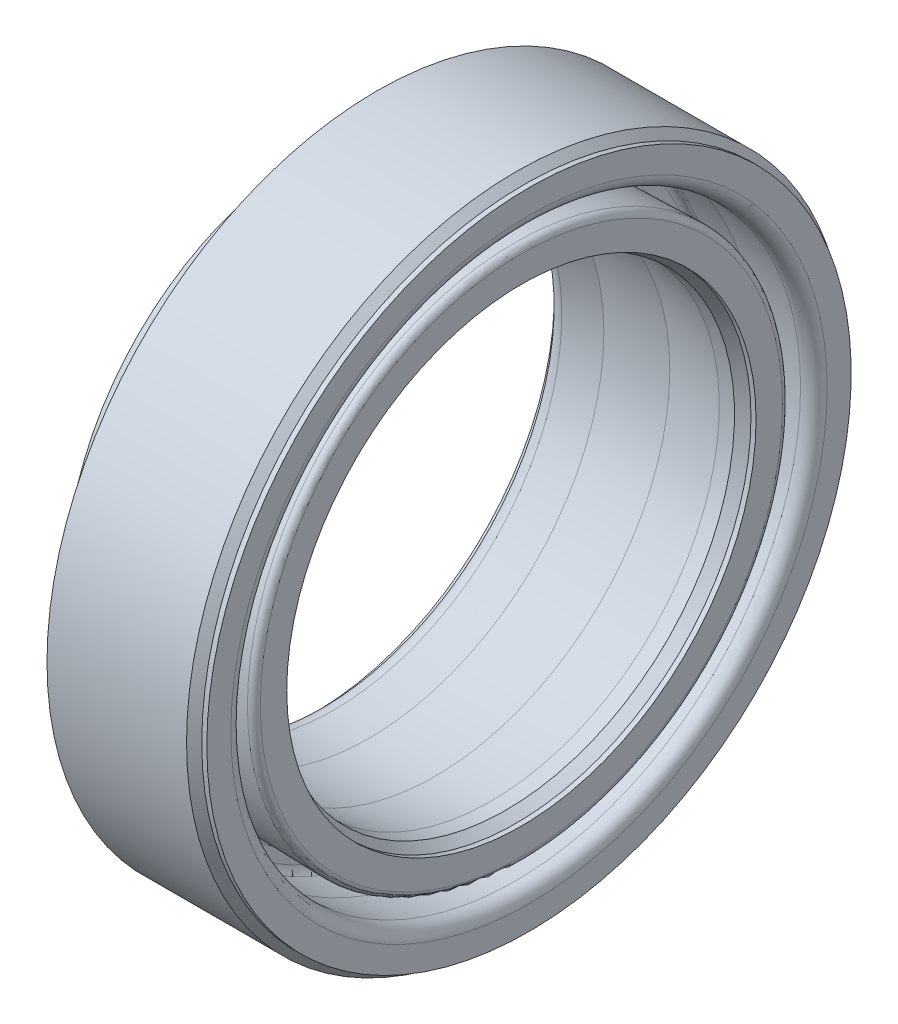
ISO-10303-21;
HEADER;
FILE_DESCRIPTION(('STEP AP214'),'2;1');
FILE_NAME('part.step','',(''),(''),'','','');
FILE_SCHEMA(('AUTOMOTIVE_DESIGN { 1 0 10303 214 1 1 1 1 }'));
ENDSEC;
DATA;
#1=APPLICATION_CONTEXT('core data for automotive mechanical design processes');
#2=APPLICATION_PROTOCOL_DEFINITION('international standard','automotive_design',2000,#1);
#3=PRODUCT_CONTEXT('',#1,'mechanical');
#4=PRODUCT('Part','Part','',(#3));
#5=PRODUCT_RELATED_PRODUCT_CATEGORY('part','',(#4));
#6=PRODUCT_DEFINITION_FORMATION('','',#4);
#7=PRODUCT_DEFINITION_CONTEXT('part definition',#1,'design');
#8=PRODUCT_DEFINITION('design','',#6,#7);
#9=PRODUCT_DEFINITION_SHAPE('','',#8);
#10=(LENGTH_UNIT() NAMED_UNIT(*) SI_UNIT(.MILLI.,.METRE.));
#11=(NAMED_UNIT(*) PLANE_ANGLE_UNIT() SI_UNIT($,.RADIAN.));
#12=(NAMED_UNIT(*) SI_UNIT($,.STERADIAN.) SOLID_ANGLE_UNIT());
#13=UNCERTAINTY_MEASURE_WITH_UNIT(LENGTH_MEASURE(1.E-05),#10,'distance_accuracy_value','');
#14=(GEOMETRIC_REPRESENTATION_CONTEXT(3) GLOBAL_UNCERTAINTY_ASSIGNED_CONTEXT((#13)) GLOBAL_UNIT_ASSIGNED_CONTEXT((#10,
#11,#12)) REPRESENTATION_CONTEXT('',''));
#15=CARTESIAN_POINT('',(0.,0.,0.));
#16=DIRECTION('',(0.,0.,1.));
#17=DIRECTION('',(1.,0.,0.));
#18=AXIS2_PLACEMENT_3D('',#15,#16,#17);
#19=CARTESIAN_POINT('',(563.646090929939,439.492949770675,0.));
#20=DIRECTION('',(-1.,0.,0.));
#21=DIRECTION('',(0.,0.,1.));
#22=AXIS2_PLACEMENT_3D('',#19,#20,#21);
#23=CYLINDRICAL_SURFACE('',#22,13.);
#24=CARTESIAN_POINT('',(575.435578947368,439.492949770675,0.));
#25=DIRECTION('',(-1.,0.,0.));
#26=DIRECTION('',(0.,0.,1.));
#27=AXIS2_PLACEMENT_3D('',#24,#25,#26);
#28=CIRCLE('',#27,13.);
#29=CARTESIAN_POINT('',(575.435578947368,439.492949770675,13.));
#30=VERTEX_POINT('',#29);
#31=EDGE_CURVE('E431',#30,#30,#28,.T.);
#32=ORIENTED_EDGE('',*,*,#31,.F.);
#33=EDGE_LOOP('',(#32));
#34=FACE_BOUND('',#33,.T.);
#35=CARTESIAN_POINT('',(580.935578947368,439.492949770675,0.));
#36=DIRECTION('',(-1.,0.,0.));
#37=DIRECTION('',(0.,0.,1.));
#38=AXIS2_PLACEMENT_3D('',#35,#36,#37);
#39=CIRCLE('',#38,13.);
#40=CARTESIAN_POINT('',(580.935578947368,439.492949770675,13.));
#41=VERTEX_POINT('',#40);
#42=EDGE_CURVE('E10',#41,#41,#39,.T.);
#43=ORIENTED_EDGE('',*,*,#42,.T.);
#44=EDGE_LOOP('',(#43));
#45=FACE_BOUND('',#44,.T.);
#46=ADVANCED_FACE('F346',(#34,#45),#23,.T.);
#47=CARTESIAN_POINT('',(581.235578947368,439.492949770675,0.));
#48=DIRECTION('',(-1.,0.,0.));
#49=DIRECTION('',(0.,0.,1.));
#50=AXIS2_PLACEMENT_3D('',#47,#48,#49);
#51=CONICAL_SURFACE('',#50,12.7,0.785398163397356);
#52=ORIENTED_EDGE('',*,*,#42,.F.);
#53=EDGE_LOOP('',(#52));
#54=FACE_BOUND('',#53,.T.);
#55=CARTESIAN_POINT('',(581.235578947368,439.492949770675,0.));
#56=DIRECTION('',(-1.,0.,0.));
#57=DIRECTION('',(0.,0.,1.));
#58=AXIS2_PLACEMENT_3D('',#55,#56,#57);
#59=CIRCLE('',#58,12.7);
#60=CARTESIAN_POINT('',(581.235578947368,439.492949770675,12.7));
#61=VERTEX_POINT('',#60);
#62=EDGE_CURVE('E352',#61,#61,#59,.T.);
#63=ORIENTED_EDGE('',*,*,#62,.T.);
#64=EDGE_LOOP('',(#63));
#65=FACE_BOUND('',#64,.T.);
#66=ADVANCED_FACE('F438',(#54,#65),#51,.T.);
#67=CARTESIAN_POINT('',(563.646090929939,439.492949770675,0.));
#68=DIRECTION('',(-1.,0.,0.));
#69=DIRECTION('',(0.,0.,1.));
#70=AXIS2_PLACEMENT_3D('',#67,#68,#69);
#71=CYLINDRICAL_SURFACE('',#70,12.7);
#72=ORIENTED_EDGE('',*,*,#62,.F.);
#73=EDGE_LOOP('',(#72));
#74=FACE_BOUND('',#73,.T.);
#75=CARTESIAN_POINT('',(581.435578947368,439.492949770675,0.));
#76=DIRECTION('',(-1.,0.,0.));
#77=DIRECTION('',(0.,0.,1.));
#78=AXIS2_PLACEMENT_3D('',#75,#76,#77);
#79=CIRCLE('',#78,12.7);
#80=CARTESIAN_POINT('',(581.435578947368,439.492949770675,12.7));
#81=VERTEX_POINT('',#80);
#82=EDGE_CURVE('E356',#81,#81,#79,.T.);
#83=ORIENTED_EDGE('',*,*,#82,.T.);
#84=EDGE_LOOP('',(#83));
#85=FACE_BOUND('',#84,.T.);
#86=ADVANCED_FACE('F442',(#74,#85),#71,.T.);
#87=CARTESIAN_POINT('',(581.435578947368,452.192949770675,0.));
#88=DIRECTION('',(-1.,0.,0.));
#89=DIRECTION('',(0.,0.,1.));
#90=AXIS2_PLACEMENT_3D('',#87,#88,#89);
#91=PLANE('',#90);
#92=ORIENTED_EDGE('',*,*,#82,.F.);
#93=EDGE_LOOP('',(#92));
#94=FACE_BOUND('',#93,.T.);
#95=CARTESIAN_POINT('',(581.435578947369,439.492949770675,0.));
#96=DIRECTION('',(-1.,0.,0.));
#97=DIRECTION('',(0.,0.,1.));
#98=AXIS2_PLACEMENT_3D('',#95,#96,#97);
#99=CIRCLE('',#98,11.7524937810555);
#100=CARTESIAN_POINT('',(581.435578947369,439.492949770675,11.7524937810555));
#101=VERTEX_POINT('',#100);
#102=EDGE_CURVE('E360',#101,#101,#99,.T.);
#103=ORIENTED_EDGE('',*,*,#102,.T.);
#104=EDGE_LOOP('',(#103));
#105=FACE_BOUND('',#104,.T.);
#106=ADVANCED_FACE('F447',(#94,#105),#91,.F.);
#107=CARTESIAN_POINT('',(580.935578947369,439.492949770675,0.));
#108=DIRECTION('',(-1.,0.,0.));
#109=DIRECTION('',(0.,0.,1.));
#110=AXIS2_PLACEMENT_3D('',#107,#108,#109);
#111=TOROIDAL_SURFACE('',#110,11.7524937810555,0.500000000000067);
#112=ORIENTED_EDGE('',*,*,#102,.F.);
#113=EDGE_LOOP('',(#112));
#114=FACE_BOUND('',#113,.T.);
#115=CARTESIAN_POINT('',(580.885827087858,439.492949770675,0.));
#116=DIRECTION('',(-1.,0.,0.));
#117=DIRECTION('',(0.,0.,1.));
#118=AXIS2_PLACEMENT_3D('',#115,#116,#117);
#119=CIRCLE('',#118,11.254975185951);
#120=CARTESIAN_POINT('',(580.885827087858,439.492949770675,11.254975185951));
#121=VERTEX_POINT('',#120);
#122=EDGE_CURVE('E365',#121,#121,#119,.T.);
#123=ORIENTED_EDGE('',*,*,#122,.T.);
#124=EDGE_LOOP('',(#123));
#125=FACE_BOUND('',#124,.T.);
#126=ADVANCED_FACE('F453',(#114,#125),#111,.T.);
#127=CARTESIAN_POINT('',(578.935578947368,439.492949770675,0.));
#128=DIRECTION('',(-1.,0.,0.));
#129=DIRECTION('',(0.,0.,1.));
#130=AXIS2_PLACEMENT_3D('',#127,#128,#129);
#131=CONICAL_SURFACE('',#130,11.45,0.099668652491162);
#132=ORIENTED_EDGE('',*,*,#122,.F.);
#133=EDGE_LOOP('',(#132));
#134=FACE_BOUND('',#133,.T.);
#135=CARTESIAN_POINT('',(578.935578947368,439.492949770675,0.));
#136=DIRECTION('',(-1.,0.,0.));
#137=DIRECTION('',(0.,0.,1.));
#138=AXIS2_PLACEMENT_3D('',#135,#136,#137);
#139=CIRCLE('',#138,11.45);
#140=CARTESIAN_POINT('',(578.935578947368,439.492949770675,11.45));
#141=VERTEX_POINT('',#140);
#142=EDGE_CURVE('E368',#141,#141,#139,.T.);
#143=ORIENTED_EDGE('',*,*,#142,.T.);
#144=EDGE_LOOP('',(#143));
#145=FACE_BOUND('',#144,.T.);
#146=ADVANCED_FACE('F457',(#134,#145),#131,.F.);
#147=CARTESIAN_POINT('',(563.646090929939,439.492949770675,0.));
#148=DIRECTION('',(-1.,0.,0.));
#149=DIRECTION('',(0.,0.,1.));
#150=AXIS2_PLACEMENT_3D('',#147,#148,#149);
#151=CYLINDRICAL_SURFACE('',#150,11.4499999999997);
#152=ORIENTED_EDGE('',*,*,#142,.F.);
#153=EDGE_LOOP('',(#152));
#154=FACE_BOUND('',#153,.T.);
#155=CARTESIAN_POINT('',(577.485578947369,439.492949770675,0.));
#156=DIRECTION('',(-1.,0.,0.));
#157=DIRECTION('',(0.,0.,1.));
#158=AXIS2_PLACEMENT_3D('',#155,#156,#157);
#159=CIRCLE('',#158,11.4499999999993);
#160=CARTESIAN_POINT('',(577.485578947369,439.492949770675,11.4499999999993));
#161=VERTEX_POINT('',#160);
#162=EDGE_CURVE('E371',#161,#161,#159,.T.);
#163=ORIENTED_EDGE('',*,*,#162,.T.);
#164=EDGE_LOOP('',(#163));
#165=FACE_BOUND('',#164,.T.);
#166=ADVANCED_FACE('F461',(#154,#165),#151,.F.);
#167=CARTESIAN_POINT('',(577.485578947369,439.492949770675,0.));
#168=DIRECTION('',(-1.,0.,0.));
#169=DIRECTION('',(0.,0.,1.));
#170=AXIS2_PLACEMENT_3D('',#167,#168,#169);
#171=TOROIDAL_SURFACE('',#170,11.1999999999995,0.250000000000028);
#172=ORIENTED_EDGE('',*,*,#162,.F.);
#173=EDGE_LOOP('',(#172));
#174=FACE_BOUND('',#173,.T.);
#175=CARTESIAN_POINT('',(577.235578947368,439.492949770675,0.));
#176=DIRECTION('',(-1.,0.,0.));
#177=DIRECTION('',(0.,0.,1.));
#178=AXIS2_PLACEMENT_3D('',#175,#176,#177);
#179=CIRCLE('',#178,11.2);
#180=CARTESIAN_POINT('',(577.235578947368,439.492949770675,11.2));
#181=VERTEX_POINT('',#180);
#182=EDGE_CURVE('E374',#181,#181,#179,.T.);
#183=ORIENTED_EDGE('',*,*,#182,.T.);
#184=EDGE_LOOP('',(#183));
#185=FACE_BOUND('',#184,.T.);
#186=ADVANCED_FACE('F465',(#174,#185),#171,.F.);
#187=CARTESIAN_POINT('',(577.235578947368,450.692949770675,0.));
#188=DIRECTION('',(-1.,0.,0.));
#189=DIRECTION('',(0.,0.,1.));
#190=AXIS2_PLACEMENT_3D('',#187,#188,#189);
#191=PLANE('',#190);
#192=ORIENTED_EDGE('',*,*,#182,.F.);
#193=EDGE_LOOP('',(#192));
#194=FACE_BOUND('',#193,.T.);
#195=CARTESIAN_POINT('',(577.235578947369,439.492949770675,0.));
#196=DIRECTION('',(-1.,0.,0.));
#197=DIRECTION('',(0.,0.,1.));
#198=AXIS2_PLACEMENT_3D('',#195,#196,#197);
#199=CIRCLE('',#198,10.7064924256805);
#200=CARTESIAN_POINT('',(577.235578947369,439.492949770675,10.7064924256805));
#201=VERTEX_POINT('',#200);
#202=EDGE_CURVE('E377',#201,#201,#199,.T.);
#203=ORIENTED_EDGE('',*,*,#202,.T.);
#204=EDGE_LOOP('',(#203));
#205=FACE_BOUND('',#204,.T.);
#206=ADVANCED_FACE('F469',(#194,#205),#191,.F.);
#207=CARTESIAN_POINT('',(577.485578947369,439.492949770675,0.));
#208=DIRECTION('',(-1.,0.,0.));
#209=DIRECTION('',(0.,0.,1.));
#210=AXIS2_PLACEMENT_3D('',#207,#208,#209);
#211=TOROIDAL_SURFACE('',#210,10.7064924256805,0.249999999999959);
#212=ORIENTED_EDGE('',*,*,#202,.F.);
#213=EDGE_LOOP('',(#212));
#214=FACE_BOUND('',#213,.T.);
#215=CARTESIAN_POINT('',(577.491987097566,439.492949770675,0.));
#216=DIRECTION('',(-1.,0.,0.));
#217=DIRECTION('',(0.,0.,1.));
#218=AXIS2_PLACEMENT_3D('',#215,#216,#217);
#219=CIRCLE('',#218,10.4565745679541);
#220=CARTESIAN_POINT('',(577.491987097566,439.492949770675,10.4565745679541));
#221=VERTEX_POINT('',#220);
#222=EDGE_CURVE('E380',#221,#221,#219,.T.);
#223=ORIENTED_EDGE('',*,*,#222,.T.);
#224=EDGE_LOOP('',(#223));
#225=FACE_BOUND('',#224,.T.);
#226=ADVANCED_FACE('F473',(#214,#225),#211,.F.);
#227=CARTESIAN_POINT('',(580.879170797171,439.492949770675,0.));
#228=DIRECTION('',(1.,0.,0.));
#229=DIRECTION('',(0.,0.,-1.));
#230=AXIS2_PLACEMENT_3D('',#227,#228,#229);
#231=CONICAL_SURFACE('',#230,10.5434254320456,0.0256354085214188);
#232=ORIENTED_EDGE('',*,*,#222,.F.);
#233=EDGE_LOOP('',(#232));
#234=FACE_BOUND('',#233,.T.);
#235=CARTESIAN_POINT('',(580.879170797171,439.492949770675,0.));
#236=DIRECTION('',(-1.,0.,0.));
#237=DIRECTION('',(0.,0.,1.));
#238=AXIS2_PLACEMENT_3D('',#235,#236,#237);
#239=CIRCLE('',#238,10.5434254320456);
#240=CARTESIAN_POINT('',(580.879170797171,439.492949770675,10.5434254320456));
#241=VERTEX_POINT('',#240);
#242=EDGE_CURVE('E383',#241,#241,#239,.T.);
#243=ORIENTED_EDGE('',*,*,#242,.T.);
#244=EDGE_LOOP('',(#243));
#245=FACE_BOUND('',#244,.T.);
#246=ADVANCED_FACE('F477',(#234,#245),#231,.T.);
#247=CARTESIAN_POINT('',(580.885578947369,439.492949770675,0.));
#248=DIRECTION('',(-1.,0.,0.));
#249=DIRECTION('',(0.,0.,1.));
#250=AXIS2_PLACEMENT_3D('',#247,#248,#249);
#251=TOROIDAL_SURFACE('',#250,10.2935075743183,0.249999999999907);
#252=ORIENTED_EDGE('',*,*,#242,.F.);
#253=EDGE_LOOP('',(#252));
#254=FACE_BOUND('',#253,.T.);
#255=CARTESIAN_POINT('',(581.135578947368,439.492949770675,0.));
#256=DIRECTION('',(-1.,0.,0.));
#257=DIRECTION('',(0.,0.,1.));
#258=AXIS2_PLACEMENT_3D('',#255,#256,#257);
#259=CIRCLE('',#258,10.293507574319);
#260=CARTESIAN_POINT('',(581.135578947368,439.492949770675,10.293507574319));
#261=VERTEX_POINT('',#260);
#262=EDGE_CURVE('E386',#261,#261,#259,.T.);
#263=ORIENTED_EDGE('',*,*,#262,.T.);
#264=EDGE_LOOP('',(#263));
#265=FACE_BOUND('',#264,.T.);
#266=ADVANCED_FACE('F481',(#254,#265),#251,.T.);
#267=CARTESIAN_POINT('',(581.135578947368,449.786457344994,0.));
#268=DIRECTION('',(-1.,0.,0.));
#269=DIRECTION('',(0.,0.,1.));
#270=AXIS2_PLACEMENT_3D('',#267,#268,#269);
#271=PLANE('',#270);
#272=ORIENTED_EDGE('',*,*,#262,.F.);
#273=EDGE_LOOP('',(#272));
#274=FACE_BOUND('',#273,.T.);
#275=CARTESIAN_POINT('',(581.135578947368,439.492949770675,0.));
#276=DIRECTION('',(-1.,0.,0.));
#277=DIRECTION('',(0.,0.,1.));
#278=AXIS2_PLACEMENT_3D('',#275,#276,#277);
#279=CIRCLE('',#278,9.25000000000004);
#280=CARTESIAN_POINT('',(581.135578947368,439.492949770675,9.25000000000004));
#281=VERTEX_POINT('',#280);
#282=EDGE_CURVE('E389',#281,#281,#279,.T.);
#283=ORIENTED_EDGE('',*,*,#282,.T.);
#284=EDGE_LOOP('',(#283));
#285=FACE_BOUND('',#284,.T.);
#286=ADVANCED_FACE('F485',(#274,#285),#271,.F.);
#287=CARTESIAN_POINT('',(563.646090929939,439.492949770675,0.));
#288=DIRECTION('',(-1.,0.,0.));
#289=DIRECTION('',(0.,0.,1.));
#290=AXIS2_PLACEMENT_3D('',#287,#288,#289);
#291=CYLINDRICAL_SURFACE('',#290,9.25000000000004);
#292=ORIENTED_EDGE('',*,*,#282,.F.);
#293=EDGE_LOOP('',(#292));
#294=FACE_BOUND('',#293,.T.);
#295=CARTESIAN_POINT('',(580.935578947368,439.492949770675,0.));
#296=DIRECTION('',(-1.,0.,0.));
#297=DIRECTION('',(0.,0.,1.));
#298=AXIS2_PLACEMENT_3D('',#295,#296,#297);
#299=CIRCLE('',#298,9.25000000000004);
#300=CARTESIAN_POINT('',(580.935578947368,439.492949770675,9.25000000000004));
#301=VERTEX_POINT('',#300);
#302=EDGE_CURVE('E392',#301,#301,#299,.T.);
#303=ORIENTED_EDGE('',*,*,#302,.T.);
#304=EDGE_LOOP('',(#303));
#305=FACE_BOUND('',#304,.T.);
#306=ADVANCED_FACE('F489',(#294,#305),#291,.F.);
#307=CARTESIAN_POINT('',(580.535578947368,439.492949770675,0.));
#308=DIRECTION('',(1.,0.,0.));
#309=DIRECTION('',(0.,0.,-1.));
#310=AXIS2_PLACEMENT_3D('',#307,#308,#309);
#311=CONICAL_SURFACE('',#310,8.99999999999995,0.558599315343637);
#312=ORIENTED_EDGE('',*,*,#302,.F.);
#313=EDGE_LOOP('',(#312));
#314=FACE_BOUND('',#313,.T.);
#315=CARTESIAN_POINT('',(580.535578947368,439.492949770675,0.));
#316=DIRECTION('',(-1.,0.,0.));
#317=DIRECTION('',(0.,0.,1.));
#318=AXIS2_PLACEMENT_3D('',#315,#316,#317);
#319=CIRCLE('',#318,8.99999999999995);
#320=CARTESIAN_POINT('',(580.535578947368,439.492949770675,8.99999999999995));
#321=VERTEX_POINT('',#320);
#322=EDGE_CURVE('E395',#321,#321,#319,.T.);
#323=ORIENTED_EDGE('',*,*,#322,.T.);
#324=EDGE_LOOP('',(#323));
#325=FACE_BOUND('',#324,.T.);
#326=ADVANCED_FACE('F493',(#314,#325),#311,.F.);
#327=CARTESIAN_POINT('',(563.646090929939,439.492949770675,0.));
#328=DIRECTION('',(-1.,0.,0.));
#329=DIRECTION('',(0.,0.,1.));
#330=AXIS2_PLACEMENT_3D('',#327,#328,#329);
#331=CYLINDRICAL_SURFACE('',#330,8.99999999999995);
#332=ORIENTED_EDGE('',*,*,#322,.F.);
#333=EDGE_LOOP('',(#332));
#334=FACE_BOUND('',#333,.T.);
#335=CARTESIAN_POINT('',(579.935578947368,439.492949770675,0.));
#336=DIRECTION('',(-1.,0.,0.));
#337=DIRECTION('',(0.,0.,1.));
#338=AXIS2_PLACEMENT_3D('',#335,#336,#337);
#339=CIRCLE('',#338,8.99999999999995);
#340=CARTESIAN_POINT('',(579.935578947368,439.492949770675,8.99999999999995));
#341=VERTEX_POINT('',#340);
#342=EDGE_CURVE('E398',#341,#341,#339,.T.);
#343=ORIENTED_EDGE('',*,*,#342,.T.);
#344=EDGE_LOOP('',(#343));
#345=FACE_BOUND('',#344,.T.);
#346=ADVANCED_FACE('F497',(#334,#345),#331,.F.);
#347=CARTESIAN_POINT('',(577.735578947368,439.492949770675,0.));
#348=DIRECTION('',(-1.,0.,0.));
#349=DIRECTION('',(0.,0.,1.));
#350=AXIS2_PLACEMENT_3D('',#347,#348,#349);
#351=CONICAL_SURFACE('',#350,9.25000000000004,0.113150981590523);
#352=ORIENTED_EDGE('',*,*,#342,.F.);
#353=EDGE_LOOP('',(#352));
#354=FACE_BOUND('',#353,.T.);
#355=CARTESIAN_POINT('',(577.735578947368,439.492949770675,0.));
#356=DIRECTION('',(-1.,0.,0.));
#357=DIRECTION('',(0.,0.,1.));
#358=AXIS2_PLACEMENT_3D('',#355,#356,#357);
#359=CIRCLE('',#358,9.25000000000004);
#360=CARTESIAN_POINT('',(577.735578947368,439.492949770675,9.25000000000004));
#361=VERTEX_POINT('',#360);
#362=EDGE_CURVE('E401',#361,#361,#359,.T.);
#363=ORIENTED_EDGE('',*,*,#362,.T.);
#364=EDGE_LOOP('',(#363));
#365=FACE_BOUND('',#364,.T.);
#366=ADVANCED_FACE('F501',(#354,#365),#351,.F.);
#367=CARTESIAN_POINT('',(563.646090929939,439.492949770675,0.));
#368=DIRECTION('',(-1.,0.,0.));
#369=DIRECTION('',(0.,0.,1.));
#370=AXIS2_PLACEMENT_3D('',#367,#368,#369);
#371=CYLINDRICAL_SURFACE('',#370,9.25000000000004);
#372=ORIENTED_EDGE('',*,*,#362,.F.);
#373=EDGE_LOOP('',(#372));
#374=FACE_BOUND('',#373,.T.);
#375=CARTESIAN_POINT('',(575.135578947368,439.492949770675,0.));
#376=DIRECTION('',(-1.,0.,0.));
#377=DIRECTION('',(0.,0.,1.));
#378=AXIS2_PLACEMENT_3D('',#375,#376,#377);
#379=CIRCLE('',#378,9.25000000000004);
#380=CARTESIAN_POINT('',(575.135578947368,439.492949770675,9.25000000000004));
#381=VERTEX_POINT('',#380);
#382=EDGE_CURVE('E404',#381,#381,#379,.T.);
#383=ORIENTED_EDGE('',*,*,#382,.T.);
#384=EDGE_LOOP('',(#383));
#385=FACE_BOUND('',#384,.T.);
#386=ADVANCED_FACE('F505',(#374,#385),#371,.F.);
#387=CARTESIAN_POINT('',(573.720111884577,439.492949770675,0.));
#388=DIRECTION('',(1.,0.,0.));
#389=DIRECTION('',(0.,0.,-1.));
#390=AXIS2_PLACEMENT_3D('',#387,#388,#389);
#391=CONICAL_SURFACE('',#390,9.00719762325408,0.16988182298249);
#392=ORIENTED_EDGE('',*,*,#382,.F.);
#393=EDGE_LOOP('',(#392));
#394=FACE_BOUND('',#393,.T.);
#395=CARTESIAN_POINT('',(573.720111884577,439.492949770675,0.));
#396=DIRECTION('',(-1.,0.,0.));
#397=DIRECTION('',(0.,0.,1.));
#398=AXIS2_PLACEMENT_3D('',#395,#396,#397);
#399=CIRCLE('',#398,9.00719762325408);
#400=CARTESIAN_POINT('',(573.720111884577,439.492949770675,9.00719762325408));
#401=VERTEX_POINT('',#400);
#402=EDGE_CURVE('E407',#401,#401,#399,.T.);
#403=ORIENTED_EDGE('',*,*,#402,.T.);
#404=EDGE_LOOP('',(#403));
#405=FACE_BOUND('',#404,.T.);
#406=ADVANCED_FACE('F509',(#394,#405),#391,.F.);
#407=CARTESIAN_POINT('',(573.635578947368,439.492949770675,0.));
#408=DIRECTION('',(-1.,0.,0.));
#409=DIRECTION('',(0.,0.,1.));
#410=AXIS2_PLACEMENT_3D('',#407,#408,#409);
#411=TOROIDAL_SURFACE('',#410,9.50000000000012,0.499999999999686);
#412=ORIENTED_EDGE('',*,*,#402,.F.);
#413=EDGE_LOOP('',(#412));
#414=FACE_BOUND('',#413,.T.);
#415=CARTESIAN_POINT('',(573.135578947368,439.492949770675,0.));
#416=DIRECTION('',(-1.,0.,0.));
#417=DIRECTION('',(0.,0.,1.));
#418=AXIS2_PLACEMENT_3D('',#415,#416,#417);
#419=CIRCLE('',#418,9.49999999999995);
#420=CARTESIAN_POINT('',(573.135578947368,439.492949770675,9.49999999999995));
#421=VERTEX_POINT('',#420);
#422=EDGE_CURVE('E410',#421,#421,#419,.T.);
#423=ORIENTED_EDGE('',*,*,#422,.T.);
#424=EDGE_LOOP('',(#423));
#425=FACE_BOUND('',#424,.T.);
#426=ADVANCED_FACE('F513',(#414,#425),#411,.T.);
#427=CARTESIAN_POINT('',(563.646090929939,439.492949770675,0.));
#428=DIRECTION('',(-1.,0.,0.));
#429=DIRECTION('',(0.,0.,1.));
#430=AXIS2_PLACEMENT_3D('',#427,#428,#429);
#431=CYLINDRICAL_SURFACE('',#430,9.49999999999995);
#432=ORIENTED_EDGE('',*,*,#422,.F.);
#433=EDGE_LOOP('',(#432));
#434=FACE_BOUND('',#433,.T.);
#435=CARTESIAN_POINT('',(572.935578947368,439.492949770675,0.));
#436=DIRECTION('',(-1.,0.,0.));
#437=DIRECTION('',(0.,0.,1.));
#438=AXIS2_PLACEMENT_3D('',#435,#436,#437);
#439=CIRCLE('',#438,9.49999999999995);
#440=CARTESIAN_POINT('',(572.935578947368,439.492949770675,9.49999999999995));
#441=VERTEX_POINT('',#440);
#442=EDGE_CURVE('E413',#441,#441,#439,.T.);
#443=ORIENTED_EDGE('',*,*,#442,.T.);
#444=EDGE_LOOP('',(#443));
#445=FACE_BOUND('',#444,.T.);
#446=ADVANCED_FACE('F517',(#434,#445),#431,.F.);
#447=CARTESIAN_POINT('',(572.935578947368,448.992949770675,0.));
#448=DIRECTION('',(1.,0.,0.));
#449=DIRECTION('',(0.,0.,-1.));
#450=AXIS2_PLACEMENT_3D('',#447,#448,#449);
#451=PLANE('',#450);
#452=ORIENTED_EDGE('',*,*,#442,.F.);
#453=EDGE_LOOP('',(#452));
#454=FACE_BOUND('',#453,.T.);
#455=CARTESIAN_POINT('',(572.935578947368,439.492949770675,0.));
#456=DIRECTION('',(-1.,0.,0.));
#457=DIRECTION('',(0.,0.,1.));
#458=AXIS2_PLACEMENT_3D('',#455,#456,#457);
#459=CIRCLE('',#458,9.75000000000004);
#460=CARTESIAN_POINT('',(572.935578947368,439.492949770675,9.75000000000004));
#461=VERTEX_POINT('',#460);
#462=EDGE_CURVE('E416',#461,#461,#459,.T.);
#463=ORIENTED_EDGE('',*,*,#462,.T.);
#464=EDGE_LOOP('',(#463));
#465=FACE_BOUND('',#464,.T.);
#466=ADVANCED_FACE('F521',(#454,#465),#451,.F.);
#467=CARTESIAN_POINT('',(574.751868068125,439.492949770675,0.));
#468=DIRECTION('',(1.,0.,0.));
#469=DIRECTION('',(0.,0.,-1.));
#470=AXIS2_PLACEMENT_3D('',#467,#468,#469);
#471=CONICAL_SURFACE('',#470,10.2494795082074,0.268366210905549);
#472=ORIENTED_EDGE('',*,*,#462,.F.);
#473=EDGE_LOOP('',(#472));
#474=FACE_BOUND('',#473,.T.);
#475=CARTESIAN_POINT('',(574.751868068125,439.492949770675,0.));
#476=DIRECTION('',(-1.,0.,0.));
#477=DIRECTION('',(0.,0.,1.));
#478=AXIS2_PLACEMENT_3D('',#475,#476,#477);
#479=CIRCLE('',#478,10.2494795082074);
#480=CARTESIAN_POINT('',(574.751868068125,439.492949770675,10.2494795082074));
#481=VERTEX_POINT('',#480);
#482=EDGE_CURVE('E419',#481,#481,#479,.T.);
#483=ORIENTED_EDGE('',*,*,#482,.T.);
#484=EDGE_LOOP('',(#483));
#485=FACE_BOUND('',#484,.T.);
#486=ADVANCED_FACE('F525',(#474,#485),#471,.T.);
#487=CARTESIAN_POINT('',(574.685578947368,439.492949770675,0.));
#488=DIRECTION('',(-1.,0.,0.));
#489=DIRECTION('',(0.,0.,1.));
#490=AXIS2_PLACEMENT_3D('',#487,#488,#489);
#491=TOROIDAL_SURFACE('',#490,10.4905308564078,0.250000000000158);
#492=ORIENTED_EDGE('',*,*,#482,.F.);
#493=EDGE_LOOP('',(#492));
#494=FACE_BOUND('',#493,.T.);
#495=CARTESIAN_POINT('',(574.935578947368,439.492949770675,0.));
#496=DIRECTION('',(-1.,0.,0.));
#497=DIRECTION('',(0.,0.,1.));
#498=AXIS2_PLACEMENT_3D('',#495,#496,#497);
#499=CIRCLE('',#498,10.4905308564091);
#500=CARTESIAN_POINT('',(574.935578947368,439.492949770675,10.4905308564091));
#501=VERTEX_POINT('',#500);
#502=EDGE_CURVE('E422',#501,#501,#499,.T.);
#503=ORIENTED_EDGE('',*,*,#502,.T.);
#504=EDGE_LOOP('',(#503));
#505=FACE_BOUND('',#504,.T.);
#506=ADVANCED_FACE('F529',(#494,#505),#491,.F.);
#507=CARTESIAN_POINT('',(574.935578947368,450.292949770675,0.));
#508=DIRECTION('',(1.,0.,0.));
#509=DIRECTION('',(0.,0.,-1.));
#510=AXIS2_PLACEMENT_3D('',#507,#508,#509);
#511=PLANE('',#510);
#512=ORIENTED_EDGE('',*,*,#502,.F.);
#513=EDGE_LOOP('',(#512));
#514=FACE_BOUND('',#513,.T.);
#515=CARTESIAN_POINT('',(574.935578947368,439.492949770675,0.));
#516=DIRECTION('',(-1.,0.,0.));
#517=DIRECTION('',(0.,0.,1.));
#518=AXIS2_PLACEMENT_3D('',#515,#516,#517);
#519=CIRCLE('',#518,10.8);
#520=CARTESIAN_POINT('',(574.935578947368,439.492949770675,10.8));
#521=VERTEX_POINT('',#520);
#522=EDGE_CURVE('E425',#521,#521,#519,.T.);
#523=ORIENTED_EDGE('',*,*,#522,.T.);
#524=EDGE_LOOP('',(#523));
#525=FACE_BOUND('',#524,.T.);
#526=ADVANCED_FACE('F533',(#514,#525),#511,.F.);
#527=CARTESIAN_POINT('',(575.435578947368,439.492949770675,0.));
#528=DIRECTION('',(1.,0.,0.));
#529=DIRECTION('',(0.,0.,-1.));
#530=AXIS2_PLACEMENT_3D('',#527,#528,#529);
#531=CONICAL_SURFACE('',#530,11.0500000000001,0.463647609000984);
#532=ORIENTED_EDGE('',*,*,#522,.F.);
#533=EDGE_LOOP('',(#532));
#534=FACE_BOUND('',#533,.T.);
#535=CARTESIAN_POINT('',(575.435578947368,439.492949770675,0.));
#536=DIRECTION('',(-1.,0.,0.));
#537=DIRECTION('',(0.,0.,1.));
#538=AXIS2_PLACEMENT_3D('',#535,#536,#537);
#539=CIRCLE('',#538,11.0500000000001);
#540=CARTESIAN_POINT('',(575.435578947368,439.492949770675,11.0500000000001));
#541=VERTEX_POINT('',#540);
#542=EDGE_CURVE('E428',#541,#541,#539,.T.);
#543=ORIENTED_EDGE('',*,*,#542,.T.);
#544=EDGE_LOOP('',(#543));
#545=FACE_BOUND('',#544,.T.);
#546=ADVANCED_FACE('F537',(#534,#545),#531,.T.);
#547=CARTESIAN_POINT('',(575.435578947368,452.492949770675,0.));
#548=DIRECTION('',(1.,0.,0.));
#549=DIRECTION('',(0.,0.,-1.));
#550=AXIS2_PLACEMENT_3D('',#547,#548,#549);
#551=PLANE('',#550);
#552=ORIENTED_EDGE('',*,*,#542,.F.);
#553=EDGE_LOOP('',(#552));
#554=FACE_BOUND('',#553,.T.);
#555=ORIENTED_EDGE('',*,*,#31,.T.);
#556=EDGE_LOOP('',(#555));
#557=FACE_BOUND('',#556,.T.);
#558=ADVANCED_FACE('F435',(#554,#557),#551,.F.);
#559=CLOSED_SHELL('',(#46,#66,#86,#106,#126,#146,#166,#186,#206,#226,#246,#266,#286,#306,#326,
#346,#366,#386,#406,#426,#446,#466,#486,#506,#526,#546,#558));
#560=MANIFOLD_SOLID_BREP('B2',#559);
#561=ADVANCED_BREP_SHAPE_REPRESENTATION('',(#18,#560),#14);
#562=SHAPE_DEFINITION_REPRESENTATION(#9,#561);
ENDSEC;
END-ISO-10303-21;
